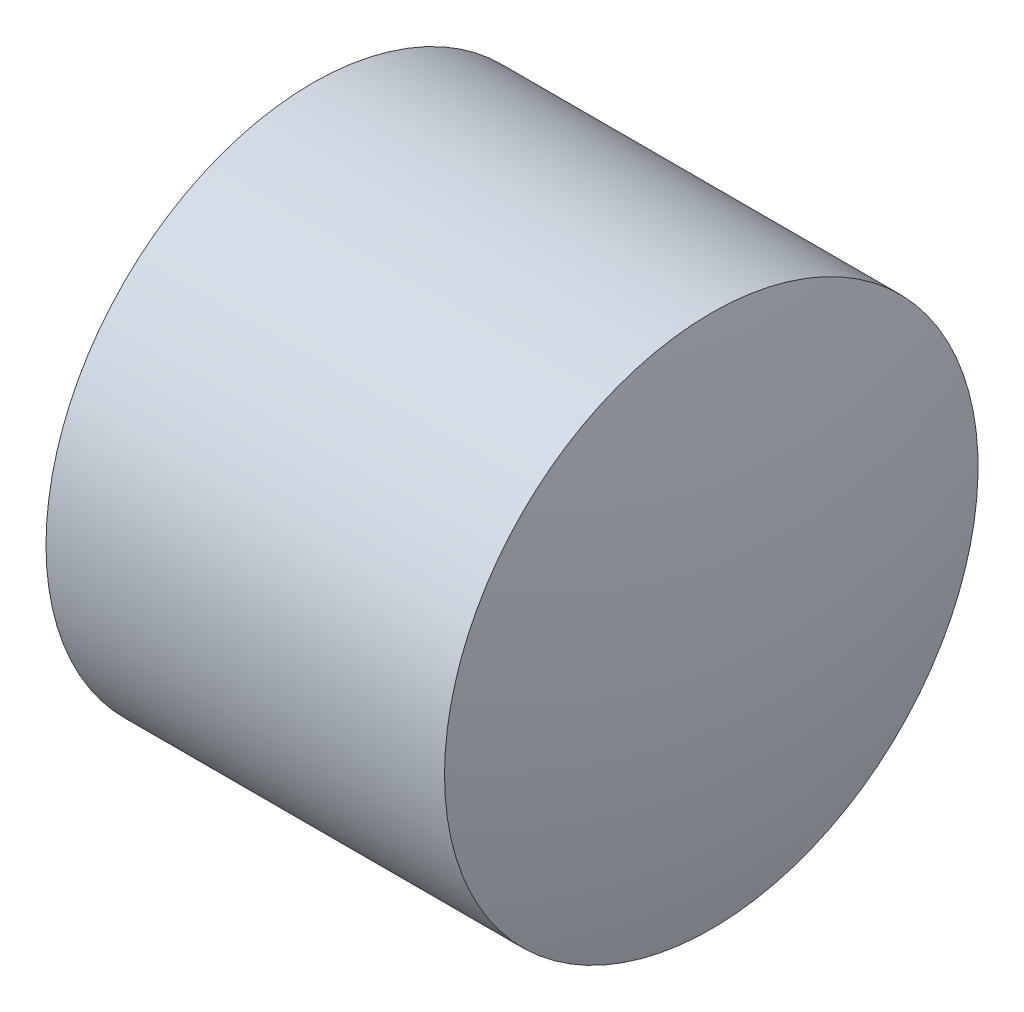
from build123d import *


with BuildPart() as part:
    # Skizze1 → Rotation1 (revolve)
    with BuildSketch(Plane.XY.offset(8)):
        with BuildLine():
            Line((19.375444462, 2.5), (23.110107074, 2.5))
            ThreePointArc((23.110107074, 2.5), (23.353436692, 1.260511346), (23.435, 0))
            Line((23.435, 0), (18.835, 0))
            ThreePointArc((18.835, 0), (18.971653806, 1.278874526), (19.375444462, 2.5))
        make_face()
    revolve(axis=Axis((0, 0, 8), (1, 0, 0)))


solid = part.part
